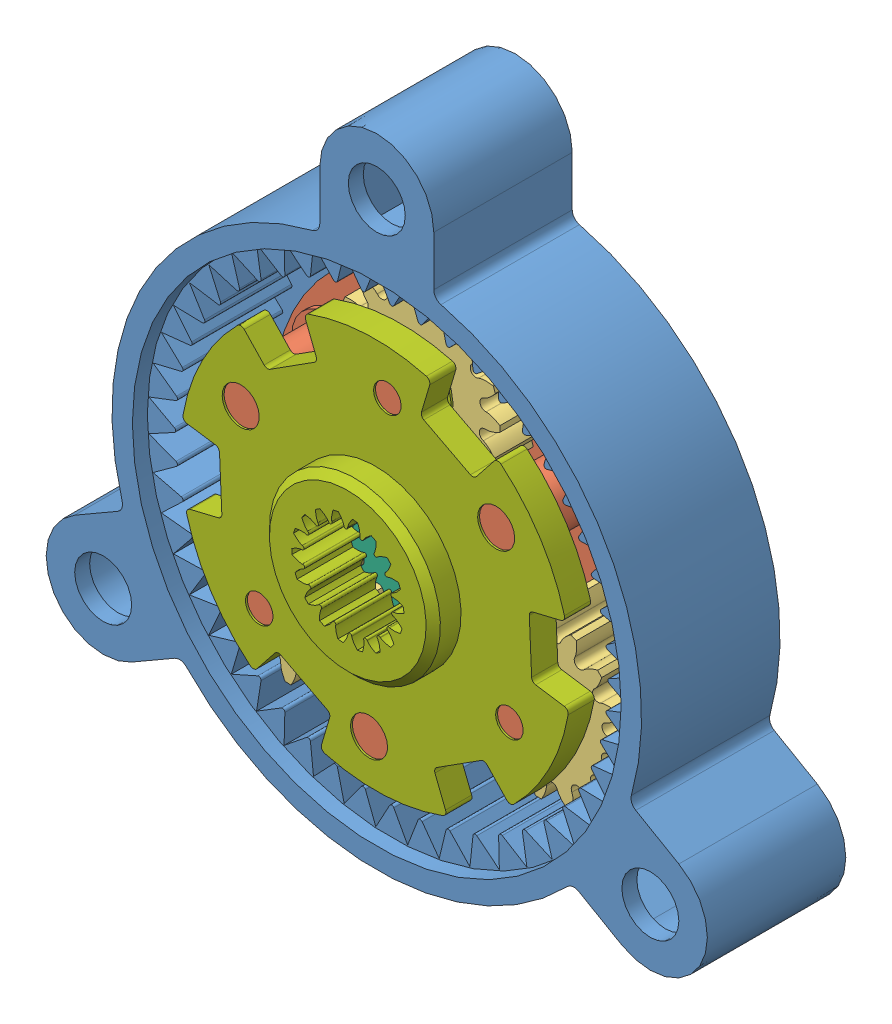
SolidWorks assembly A_TanSet.SLDASM, configuration Default (file format 9000). Lengths in mm.
Overall size (35.35 34.1 10.13).
10 component instances, 7 part files, 19 mates.
Components (placement in the parent):
- HousingCase-1: HousingCase.SLDPRT [Default] at origin size (35.35 34.1 7.98)
- TanArmDisk-1: TanArmDisk.SLDPRT [Default] at (0 0 -6.1341) x (0.461338 0.887224 0) z (0 0 1) size (20.9 20.9 6.81)
- TanPlanetGear-1: TanPlanetGear.SLDPRT [Default] at (0.629 8.0399 -4.6101) x (-0.020803 -0.999784 0) z (0 0 1) size (8.71 8.71 3.01)
- TanPlanetGear-2: TanPlanetGear.SLDPRT [Default] at (-6.2204 -5.1325 -4.6101) x (-0.686184 0.727428 0) z (0 0 1) size (8.71 8.71 3.01)
- TanPlanetGear-3: TanPlanetGear.SLDPRT [Default] at (7.155 -3.7205 -4.6101) x (0.358152 -0.933663 0) z (0 0 1) size (8.71 8.71 3.01)
- TanSunGear-1: TanSunGear.SLDASM [Default] at (0 0 -8.5852) x (0.340281 0.940324 0) z (0 0 1) size (8.97 8.97 6.65)
  - TanIntermediaryPlate-1: TanIntermediaryPlate.SLDPRT [Default] at (0 0 3.0099) size (8.97 8.97 0.64)
  - TanSpurSmall-1: TanSpurSmall.SLDPRT [Default] x (-1 0 0) z (0 0 1) size (5.78 5.84 3.01)
  - TanSpurLarge-1: TanSpurLarge.SLDPRT [Default] at (0 0 3.6449) size (8.97 8.97 3.01)
- TanDriveDisk-1: TanDriveDisk.SLDPRT [Default] at (0 0 0.0635) x (-0.461338 -0.887224 0) z (0 0 -1) size (20.43 20.9 2.98)
Mates (geometry in assembly coordinates):
- Concentric1: concentric aligned: circle of TanArmDisk-1; circle of TanPlanetGear-1
- Concentric2: concentric aligned: circle of TanArmDisk-1; circle of TanPlanetGear-2
- Concentric3: concentric aligned: circle of TanArmDisk-1; circle of TanPlanetGear-3
- Coincident3: coincident anti-aligned: plane of TanArmDisk-1 through (0.629 8.0399 -4.6101) normal (0 0 1); plane of TanPlanetGear-1 through (0.629 8.0399 -4.6101) normal (0 0 -1)
- Coincident4: coincident anti-aligned: plane of TanArmDisk-1 through (-6.2204 -5.1325 -4.6101) normal (0 0 1); plane of TanPlanetGear-2 through (-6.2204 -5.1325 -4.6101) normal (0 0 -1)
- Coincident5: coincident anti-aligned: plane of TanArmDisk-1 through (7.155 -3.7205 -4.6101) normal (0 0 1); plane of TanPlanetGear-3 through (7.155 -3.7205 -4.6101) normal (0 0 -1)
- Coincident7: coincident anti-aligned: circle of TanArmDisk-1; circle of TanDriveDisk-1
- Coincident8: coincident anti-aligned: circle of TanArmDisk-1; circle of TanDriveDisk-1
- Coincident9: coincident anti-aligned: plane of TanArmDisk-1 through (0 0 -6.1341) normal (0 0 -1); plane of HousingCase-1 through (0 9.906 -6.1341) normal (0 0 1)
- Coincident10: coordinate: point of HousingCase-1; point of assembly
- Concentric4: concentric aligned: cylinder of HousingCase-1 through (0 0 0) axis (0 0 -1) radius 9.906; cylinder of TanArmDisk-1 through (0 0 -4.9403) axis (0 0 -1) radius 4.9276
- Concentric5: concentric aligned: cylinder of TanArmDisk-1 through (0 0 -4.9403) axis (0 0 -1) radius 4.9276; cylinder of TanSunGear-1/TanIntermediaryPlate-1 through (0 0 -4.9403) axis (0 0 -1) radius 4.4831
- Coincident11: coincident aligned: plane of TanArmDisk-1 through (0 0 -4.9403) normal (0 0 1); plane of TanSunGear-1/TanIntermediaryPlate-1 through (0 0 -4.9403) normal (0 0 1)
- Coincident12: coincident anti-aligned: plane of TanSunGear-1; plane of assembly through (0 0 0) normal (1 0 0)
- Coincident15: coincident aligned: plane of TanArmDisk-1 through (0 0 -6.1341) normal (1 0 0); plane of assembly through (0 0 0) normal (1 0 0)
- GearMate5: gear = 406.4 mm: circle of TanPlanetGear-2; circle of TanSunGear-1/TanIntermediaryPlate-1
- GearMate6: gear = 1219.2 mm: circle of TanPlanetGear-2; circle of HousingCase-1
- GearMate7: gear = 1219.2 mm: circle of TanPlanetGear-3; circle of HousingCase-1
- GearMate8: gear = 1219.2 mm: circle of TanPlanetGear-1; circle of HousingCase-1
